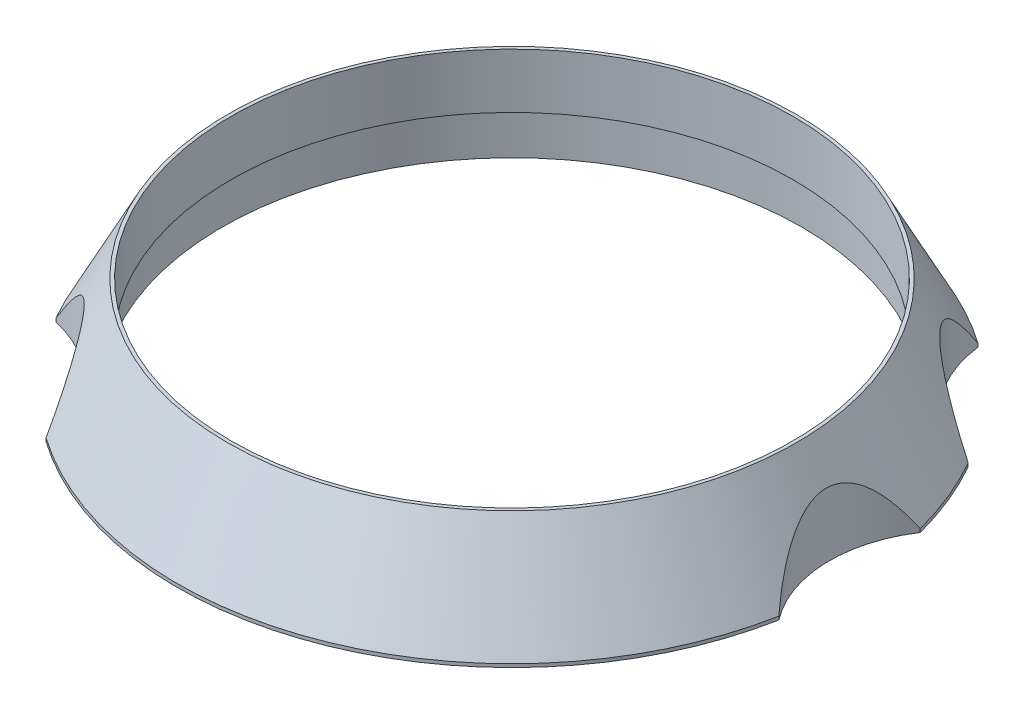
from build123d import *

# Parameters (mm, degrees)
SKETCH5_R                         = 47.879
CUT_EXTRUDE1_DEPTH                = 184.601770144
F_1_4_20_TAPPED_HOLE1_D           = 5.1054
F_1_4_20_TAPPED_HOLE1_DEPTH       = 12.7
F_1_4_20_TAPPED_HOLE1_CBORE_D     = 6.35
F_1_4_20_TAPPED_HOLE1_CBORE_DEPTH = 8.89


with BuildPart() as part:
    # Sketch1 → Revolve1 (revolve)
    with BuildSketch(Plane.XY, mode=Mode.PRIVATE) as revolve1_sk:
        Polygon((-106.6927, 38.1), (-107.9627, 38.1), (-127, 1.27), (-127, 0), (-110.0455, 0), (-110.0455, 17.272), (-106.6927, 17.272), align=None)
    revolve(revolve1_sk.sketch.rotate(Axis((0, 0, 0), (0, 1, 0)), 270), axis=Axis((0, 0, 0), (0, 1, 0)))

    # Sketch5 → Cut-Extrude1 (cut, through all)
    with BuildSketch(Plane(origin=(0, 38.1, 0), x_dir=(1, 0, 0), z_dir=(0, 1, 0))):
        with Locations((-162.780464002, -5.621436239)):
            Circle(SKETCH5_R)
        with Locations((-120.46982264, -109.617981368)):
            Circle(SKETCH5_R)
        with Locations((120.46982264, 109.617981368)):
            Circle(SKETCH5_R)
        with Locations((162.780464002, 5.621436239)):
            Circle(SKETCH5_R)
    extrude(amount=-CUT_EXTRUDE1_DEPTH, mode=Mode.SUBTRACT)

    # 1_4-20 Tapped Hole1
    with Locations(Plane(origin=(0, 0, 0), x_dir=(-1, 0, 0), z_dir=(0, -1, 0))):
        with Locations((-95.78213915, -66.924220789), (95.78213915, 66.924220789), (21.854627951, -114.784340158), (-21.854627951, 114.784340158), (0, 0)):
            CounterBoreHole(F_1_4_20_TAPPED_HOLE1_D / 2, F_1_4_20_TAPPED_HOLE1_CBORE_D / 2, F_1_4_20_TAPPED_HOLE1_CBORE_DEPTH, depth=F_1_4_20_TAPPED_HOLE1_DEPTH)


solid = part.part
